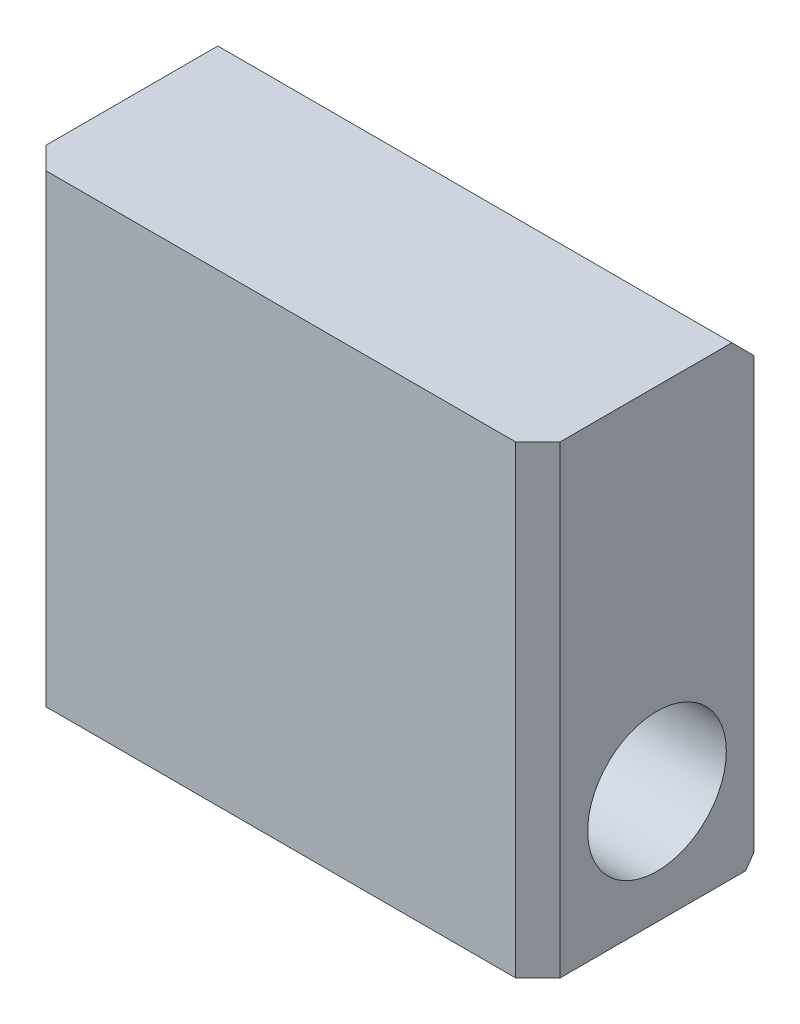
ISO-10303-21;
HEADER;
FILE_DESCRIPTION(('STEP AP214'),'2;1');
FILE_NAME('part.step','',(''),(''),'','','');
FILE_SCHEMA(('AUTOMOTIVE_DESIGN { 1 0 10303 214 1 1 1 1 }'));
ENDSEC;
DATA;
#1=APPLICATION_CONTEXT('core data for automotive mechanical design processes');
#2=APPLICATION_PROTOCOL_DEFINITION('international standard','automotive_design',2000,#1);
#3=PRODUCT_CONTEXT('',#1,'mechanical');
#4=PRODUCT('Part','Part','',(#3));
#5=PRODUCT_RELATED_PRODUCT_CATEGORY('part','',(#4));
#6=PRODUCT_DEFINITION_FORMATION('','',#4);
#7=PRODUCT_DEFINITION_CONTEXT('part definition',#1,'design');
#8=PRODUCT_DEFINITION('design','',#6,#7);
#9=PRODUCT_DEFINITION_SHAPE('','',#8);
#10=(LENGTH_UNIT() NAMED_UNIT(*) SI_UNIT(.MILLI.,.METRE.));
#11=(NAMED_UNIT(*) PLANE_ANGLE_UNIT() SI_UNIT($,.RADIAN.));
#12=(NAMED_UNIT(*) SI_UNIT($,.STERADIAN.) SOLID_ANGLE_UNIT());
#13=UNCERTAINTY_MEASURE_WITH_UNIT(LENGTH_MEASURE(1.E-05),#10,'distance_accuracy_value','');
#14=(GEOMETRIC_REPRESENTATION_CONTEXT(3) GLOBAL_UNCERTAINTY_ASSIGNED_CONTEXT((#13)) GLOBAL_UNIT_ASSIGNED_CONTEXT((#10,
#11,#12)) REPRESENTATION_CONTEXT('',''));
#15=CARTESIAN_POINT('',(0.,0.,0.));
#16=DIRECTION('',(0.,0.,1.));
#17=DIRECTION('',(1.,0.,0.));
#18=AXIS2_PLACEMENT_3D('',#15,#16,#17);
#19=CARTESIAN_POINT('',(13.2588,0.,0.));
#20=DIRECTION('',(-1.,0.,0.));
#21=DIRECTION('',(0.,0.,1.));
#22=AXIS2_PLACEMENT_3D('',#19,#20,#21);
#23=PLANE('',#22);
#24=DIRECTION('',(0.,1.,0.));
#25=VECTOR('',#24,1.);
#26=CARTESIAN_POINT('',(13.2588,0.,-5.00379999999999));
#27=LINE('',#26,#25);
#28=CARTESIAN_POINT('',(13.2588,-5.22532569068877,-5.00379999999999));
#29=VERTEX_POINT('',#28);
#30=CARTESIAN_POINT('',(13.2588,16.9672,-5.00379999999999));
#31=VERTEX_POINT('',#30);
#32=EDGE_CURVE('E180',#29,#31,#27,.T.);
#33=ORIENTED_EDGE('',*,*,#32,.T.);
#34=DIRECTION('',(0.,-0.707106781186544,-0.707106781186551));
#35=VECTOR('',#34,1.);
#36=CARTESIAN_POINT('',(13.2588,16.6328573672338,-5.33814263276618));
#37=LINE('',#36,#35);
#38=CARTESIAN_POINT('',(13.2588,18.1102,-3.86079999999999));
#39=VERTEX_POINT('',#38);
#40=EDGE_CURVE('E128',#39,#31,#37,.T.);
#41=ORIENTED_EDGE('',*,*,#40,.F.);
#42=DIRECTION('',(0.,0.,1.));
#43=VECTOR('',#42,1.);
#44=CARTESIAN_POINT('',(13.2588,18.1102,6.1468));
#45=LINE('',#44,#43);
#46=CARTESIAN_POINT('',(13.2588,18.1102,5.00379999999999));
#47=VERTEX_POINT('',#46);
#48=EDGE_CURVE('E136',#39,#47,#45,.T.);
#49=ORIENTED_EDGE('',*,*,#48,.T.);
#50=DIRECTION('',(0.,-1.,0.));
#51=VECTOR('',#50,1.);
#52=CARTESIAN_POINT('',(13.2588,0.,5.00379999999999));
#53=LINE('',#52,#51);
#54=CARTESIAN_POINT('',(13.2588,-5.842,5.00379999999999));
#55=VERTEX_POINT('',#54);
#56=EDGE_CURVE('E177',#47,#55,#53,.T.);
#57=ORIENTED_EDGE('',*,*,#56,.T.);
#58=DIRECTION('',(0.,0.,-1.));
#59=VECTOR('',#58,1.);
#60=CARTESIAN_POINT('',(13.2588,-5.842,6.1468));
#61=LINE('',#60,#59);
#62=CARTESIAN_POINT('',(13.2588,-5.842,-4.572));
#63=VERTEX_POINT('',#62);
#64=EDGE_CURVE('E146',#55,#63,#61,.T.);
#65=ORIENTED_EDGE('',*,*,#64,.T.);
#66=DIRECTION('',(0.,-0.819152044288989,0.57357643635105));
#67=VECTOR('',#66,1.);
#68=CARTESIAN_POINT('',(13.2588,-5.842,-4.572));
#69=LINE('',#68,#67);
#70=EDGE_CURVE('E203',#29,#63,#69,.T.);
#71=ORIENTED_EDGE('',*,*,#70,.F.);
#72=EDGE_LOOP('',(#33,#41,#49,#57,#65,#71));
#73=FACE_BOUND('',#72,.T.);
#74=CARTESIAN_POINT('',(13.2588,0.,0.));
#75=DIRECTION('',(1.,0.,0.));
#76=DIRECTION('',(0.,0.,-1.));
#77=AXIS2_PLACEMENT_3D('',#74,#75,#76);
#78=CIRCLE('',#77,3.57759);
#79=CARTESIAN_POINT('',(13.2588,0.,-3.57759));
#80=VERTEX_POINT('',#79);
#81=EDGE_CURVE('E152',#80,#80,#78,.T.);
#82=ORIENTED_EDGE('',*,*,#81,.F.);
#83=EDGE_LOOP('',(#82));
#84=FACE_BOUND('',#83,.T.);
#85=ADVANCED_FACE('F35',(#73,#84),#23,.F.);
#86=CARTESIAN_POINT('',(-13.2588,0.,0.));
#87=DIRECTION('',(-1.,0.,0.));
#88=DIRECTION('',(0.,0.,1.));
#89=AXIS2_PLACEMENT_3D('',#86,#87,#88);
#90=PLANE('',#89);
#91=DIRECTION('',(0.,-0.707106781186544,-0.707106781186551));
#92=VECTOR('',#91,1.);
#93=CARTESIAN_POINT('',(-13.2588,16.6328573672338,-5.33814263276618));
#94=LINE('',#93,#92);
#95=CARTESIAN_POINT('',(-13.2588,18.1102,-3.86079999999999));
#96=VERTEX_POINT('',#95);
#97=CARTESIAN_POINT('',(-13.2588,16.9672,-5.00379999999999));
#98=VERTEX_POINT('',#97);
#99=EDGE_CURVE('E118',#96,#98,#94,.T.);
#100=ORIENTED_EDGE('',*,*,#99,.T.);
#101=DIRECTION('',(0.,-1.,0.));
#102=VECTOR('',#101,1.);
#103=CARTESIAN_POINT('',(-13.2588,-5.842,-5.00379999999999));
#104=LINE('',#103,#102);
#105=CARTESIAN_POINT('',(-13.2588,-5.22532569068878,-5.00379999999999));
#106=VERTEX_POINT('',#105);
#107=EDGE_CURVE('E171',#98,#106,#104,.T.);
#108=ORIENTED_EDGE('',*,*,#107,.T.);
#109=DIRECTION('',(0.,-0.819152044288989,0.57357643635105));
#110=VECTOR('',#109,1.);
#111=CARTESIAN_POINT('',(-13.2588,-5.842,-4.572));
#112=LINE('',#111,#110);
#113=CARTESIAN_POINT('',(-13.2588,-5.842,-4.572));
#114=VERTEX_POINT('',#113);
#115=EDGE_CURVE('E209',#106,#114,#112,.T.);
#116=ORIENTED_EDGE('',*,*,#115,.T.);
#117=DIRECTION('',(0.,0.,-1.));
#118=VECTOR('',#117,1.);
#119=CARTESIAN_POINT('',(-13.2588,-5.842,6.1468));
#120=LINE('',#119,#118);
#121=CARTESIAN_POINT('',(-13.2588,-5.842,5.00379999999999));
#122=VERTEX_POINT('',#121);
#123=EDGE_CURVE('E147',#122,#114,#120,.T.);
#124=ORIENTED_EDGE('',*,*,#123,.F.);
#125=DIRECTION('',(0.,1.,0.));
#126=VECTOR('',#125,1.);
#127=CARTESIAN_POINT('',(-13.2588,18.1102,5.00379999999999));
#128=LINE('',#127,#126);
#129=CARTESIAN_POINT('',(-13.2588,18.1102,5.00379999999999));
#130=VERTEX_POINT('',#129);
#131=EDGE_CURVE('E144',#122,#130,#128,.T.);
#132=ORIENTED_EDGE('',*,*,#131,.T.);
#133=DIRECTION('',(0.,0.,1.));
#134=VECTOR('',#133,1.);
#135=CARTESIAN_POINT('',(-13.2588,18.1102,6.1468));
#136=LINE('',#135,#134);
#137=EDGE_CURVE('E133',#96,#130,#136,.T.);
#138=ORIENTED_EDGE('',*,*,#137,.F.);
#139=EDGE_LOOP('',(#100,#108,#116,#124,#132,#138));
#140=FACE_BOUND('',#139,.T.);
#141=CARTESIAN_POINT('',(-13.2588,0.,0.));
#142=DIRECTION('',(1.,0.,0.));
#143=DIRECTION('',(0.,0.,-1.));
#144=AXIS2_PLACEMENT_3D('',#141,#142,#143);
#145=CIRCLE('',#144,3.57759);
#146=CARTESIAN_POINT('',(-13.2588,0.,-3.57759));
#147=VERTEX_POINT('',#146);
#148=EDGE_CURVE('E220',#147,#147,#145,.T.);
#149=ORIENTED_EDGE('',*,*,#148,.T.);
#150=EDGE_LOOP('',(#149));
#151=FACE_BOUND('',#150,.T.);
#152=ADVANCED_FACE('F140',(#140,#151),#90,.T.);
#153=CARTESIAN_POINT('',(13.2588,-5.842,6.1468));
#154=DIRECTION('',(0.,0.,-1.));
#155=DIRECTION('',(-1.,0.,0.));
#156=AXIS2_PLACEMENT_3D('',#153,#154,#155);
#157=PLANE('',#156);
#158=DIRECTION('',(-1.,0.,0.));
#159=VECTOR('',#158,1.);
#160=CARTESIAN_POINT('',(13.2588,18.1102,6.1468));
#161=LINE('',#160,#159);
#162=CARTESIAN_POINT('',(12.1158,18.1102,6.1468));
#163=VERTEX_POINT('',#162);
#164=CARTESIAN_POINT('',(-12.1158,18.1102,6.1468));
#165=VERTEX_POINT('',#164);
#166=EDGE_CURVE('E156',#163,#165,#161,.T.);
#167=ORIENTED_EDGE('',*,*,#166,.T.);
#168=DIRECTION('',(0.,-1.,0.));
#169=VECTOR('',#168,1.);
#170=CARTESIAN_POINT('',(-12.1158,-5.842,6.1468));
#171=LINE('',#170,#169);
#172=CARTESIAN_POINT('',(-12.1158,-5.842,6.1468));
#173=VERTEX_POINT('',#172);
#174=EDGE_CURVE('E185',#165,#173,#171,.T.);
#175=ORIENTED_EDGE('',*,*,#174,.T.);
#176=DIRECTION('',(-1.,0.,0.));
#177=VECTOR('',#176,1.);
#178=CARTESIAN_POINT('',(13.2588,-5.842,6.1468));
#179=LINE('',#178,#177);
#180=CARTESIAN_POINT('',(12.1158,-5.842,6.1468));
#181=VERTEX_POINT('',#180);
#182=EDGE_CURVE('E159',#181,#173,#179,.T.);
#183=ORIENTED_EDGE('',*,*,#182,.F.);
#184=DIRECTION('',(0.,1.,0.));
#185=VECTOR('',#184,1.);
#186=CARTESIAN_POINT('',(12.1158,-5.842,6.1468));
#187=LINE('',#186,#185);
#188=EDGE_CURVE('E183',#181,#163,#187,.T.);
#189=ORIENTED_EDGE('',*,*,#188,.T.);
#190=EDGE_LOOP('',(#167,#175,#183,#189));
#191=FACE_BOUND('',#190,.T.);
#192=ADVANCED_FACE('F233',(#191),#157,.F.);
#193=CARTESIAN_POINT('',(13.2588,-5.842,6.1468));
#194=DIRECTION('',(0.,1.,0.));
#195=DIRECTION('',(0.,0.,1.));
#196=AXIS2_PLACEMENT_3D('',#193,#194,#195);
#197=PLANE('',#196);
#198=ORIENTED_EDGE('',*,*,#123,.T.);
#199=DIRECTION('',(1.,0.,0.));
#200=VECTOR('',#199,1.);
#201=CARTESIAN_POINT('',(-13.2588,-5.842,-4.572));
#202=LINE('',#201,#200);
#203=EDGE_CURVE('E215',#114,#63,#202,.T.);
#204=ORIENTED_EDGE('',*,*,#203,.T.);
#205=ORIENTED_EDGE('',*,*,#64,.F.);
#206=DIRECTION('',(0.70710678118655,0.,-0.707106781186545));
#207=VECTOR('',#206,1.);
#208=CARTESIAN_POINT('',(13.2588,-5.842,5.00379999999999));
#209=LINE('',#208,#207);
#210=EDGE_CURVE('E173',#55,#181,#209,.F.);
#211=ORIENTED_EDGE('',*,*,#210,.T.);
#212=ORIENTED_EDGE('',*,*,#182,.T.);
#213=DIRECTION('',(-0.707106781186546,0.,-0.707106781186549));
#214=VECTOR('',#213,1.);
#215=CARTESIAN_POINT('',(-12.1158,-5.842,6.1468));
#216=LINE('',#215,#214);
#217=EDGE_CURVE('E175',#173,#122,#216,.T.);
#218=ORIENTED_EDGE('',*,*,#217,.T.);
#219=EDGE_LOOP('',(#198,#204,#205,#211,#212,#218));
#220=FACE_BOUND('',#219,.T.);
#221=ADVANCED_FACE('F231',(#220),#197,.F.);
#222=CARTESIAN_POINT('',(13.2588,-5.842,-6.1468));
#223=DIRECTION('',(0.,0.,1.));
#224=DIRECTION('',(1.,0.,0.));
#225=AXIS2_PLACEMENT_3D('',#222,#223,#224);
#226=PLANE('',#225);
#227=DIRECTION('',(0.,1.,0.));
#228=VECTOR('',#227,1.);
#229=CARTESIAN_POINT('',(-12.1158,18.1102,-6.1468));
#230=LINE('',#229,#228);
#231=CARTESIAN_POINT('',(-12.1158,-3.59295251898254,-6.1468));
#232=VERTEX_POINT('',#231);
#233=CARTESIAN_POINT('',(-12.1158,13.5060113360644,-6.1468));
#234=VERTEX_POINT('',#233);
#235=EDGE_CURVE('E163',#232,#234,#230,.T.);
#236=ORIENTED_EDGE('',*,*,#235,.T.);
#237=DIRECTION('',(1.,0.,0.));
#238=VECTOR('',#237,1.);
#239=CARTESIAN_POINT('',(-13.2588,13.5060113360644,-6.1468));
#240=LINE('',#239,#238);
#241=CARTESIAN_POINT('',(12.1158,13.5060113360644,-6.1468));
#242=VERTEX_POINT('',#241);
#243=EDGE_CURVE('E138',#234,#242,#240,.T.);
#244=ORIENTED_EDGE('',*,*,#243,.T.);
#245=DIRECTION('',(0.,-1.,0.));
#246=VECTOR('',#245,1.);
#247=CARTESIAN_POINT('',(12.1158,-5.842,-6.1468));
#248=LINE('',#247,#246);
#249=CARTESIAN_POINT('',(12.1158,-3.59295251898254,-6.1468));
#250=VERTEX_POINT('',#249);
#251=EDGE_CURVE('E57',#242,#250,#248,.T.);
#252=ORIENTED_EDGE('',*,*,#251,.T.);
#253=DIRECTION('',(1.,0.,0.));
#254=VECTOR('',#253,1.);
#255=CARTESIAN_POINT('',(-13.2588,-3.59295251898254,-6.1468));
#256=LINE('',#255,#254);
#257=EDGE_CURVE('E205',#232,#250,#256,.T.);
#258=ORIENTED_EDGE('',*,*,#257,.F.);
#259=EDGE_LOOP('',(#236,#244,#252,#258));
#260=FACE_BOUND('',#259,.T.);
#261=ADVANCED_FACE('F194',(#260),#226,.F.);
#262=CARTESIAN_POINT('',(13.2588,18.1102,6.1468));
#263=DIRECTION('',(0.,-1.,0.));
#264=DIRECTION('',(0.,0.,-1.));
#265=AXIS2_PLACEMENT_3D('',#262,#263,#264);
#266=PLANE('',#265);
#267=ORIENTED_EDGE('',*,*,#48,.F.);
#268=DIRECTION('',(1.,0.,0.));
#269=VECTOR('',#268,1.);
#270=CARTESIAN_POINT('',(-13.2588,18.1102,-3.86079999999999));
#271=LINE('',#270,#269);
#272=EDGE_CURVE('E121',#96,#39,#271,.T.);
#273=ORIENTED_EDGE('',*,*,#272,.F.);
#274=ORIENTED_EDGE('',*,*,#137,.T.);
#275=DIRECTION('',(0.707106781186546,0.,0.707106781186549));
#276=VECTOR('',#275,1.);
#277=CARTESIAN_POINT('',(-12.1158,18.1102,6.1468));
#278=LINE('',#277,#276);
#279=EDGE_CURVE('E168',#130,#165,#278,.T.);
#280=ORIENTED_EDGE('',*,*,#279,.T.);
#281=ORIENTED_EDGE('',*,*,#166,.F.);
#282=DIRECTION('',(-0.70710678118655,0.,0.707106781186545));
#283=VECTOR('',#282,1.);
#284=CARTESIAN_POINT('',(13.2588,18.1102,5.00379999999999));
#285=LINE('',#284,#283);
#286=EDGE_CURVE('E166',#163,#47,#285,.F.);
#287=ORIENTED_EDGE('',*,*,#286,.T.);
#288=EDGE_LOOP('',(#267,#273,#274,#280,#281,#287));
#289=FACE_BOUND('',#288,.T.);
#290=ADVANCED_FACE('F132',(#289),#266,.F.);
#291=CARTESIAN_POINT('',(13.2588,0.,0.));
#292=DIRECTION('',(-1.,0.,0.));
#293=DIRECTION('',(0.,0.,1.));
#294=AXIS2_PLACEMENT_3D('',#291,#292,#293);
#295=CYLINDRICAL_SURFACE('',#294,3.57759);
#296=ORIENTED_EDGE('',*,*,#81,.T.);
#297=EDGE_LOOP('',(#296));
#298=FACE_BOUND('',#297,.T.);
#299=ORIENTED_EDGE('',*,*,#148,.F.);
#300=EDGE_LOOP('',(#299));
#301=FACE_BOUND('',#300,.T.);
#302=ADVANCED_FACE('F245',(#298,#301),#295,.F.);
#303=CARTESIAN_POINT('',(-12.1158,-5.842,-6.1468));
#304=DIRECTION('',(-0.707106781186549,0.,-0.707106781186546));
#305=DIRECTION('',(0.,-1.,0.));
#306=AXIS2_PLACEMENT_3D('',#303,#304,#305);
#307=PLANE('',#306);
#308=DIRECTION('',(-0.577350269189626,0.577350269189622,0.577350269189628));
#309=VECTOR('',#308,1.);
#310=CARTESIAN_POINT('',(-4.89373333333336,8.60213333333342,-13.3688666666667));
#311=LINE('',#310,#309);
#312=CARTESIAN_POINT('',(-12.9244573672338,16.6328573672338,-5.33814263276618));
#313=VERTEX_POINT('',#312);
#314=EDGE_CURVE('E124',#313,#98,#311,.T.);
#315=ORIENTED_EDGE('',*,*,#314,.F.);
#316=DIRECTION('',(-0.242882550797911,0.939157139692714,0.242882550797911));
#317=VECTOR('',#316,1.);
#318=CARTESIAN_POINT('',(-7.70242416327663,-3.55924680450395,-10.5601758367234));
#319=LINE('',#318,#317);
#320=EDGE_CURVE('E137',#234,#313,#319,.T.);
#321=ORIENTED_EDGE('',*,*,#320,.F.);
#322=ORIENTED_EDGE('',*,*,#235,.F.);
#323=DIRECTION('',(0.497542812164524,0.710564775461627,-0.497542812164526));
#324=VECTOR('',#323,1.);
#325=CARTESIAN_POINT('',(-12.9109201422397,-4.72850176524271,-5.35167985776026));
#326=LINE('',#325,#324);
#327=EDGE_CURVE('E217',#106,#232,#326,.T.);
#328=ORIENTED_EDGE('',*,*,#327,.F.);
#329=ORIENTED_EDGE('',*,*,#107,.F.);
#330=EDGE_LOOP('',(#315,#321,#322,#328,#329));
#331=FACE_BOUND('',#330,.T.);
#332=ADVANCED_FACE('F240',(#331),#307,.T.);
#333=CARTESIAN_POINT('',(13.2588,0.,-5.00379999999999));
#334=DIRECTION('',(-0.707106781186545,0.,0.70710678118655));
#335=DIRECTION('',(0.,1.,0.));
#336=AXIS2_PLACEMENT_3D('',#333,#334,#335);
#337=PLANE('',#336);
#338=DIRECTION('',(0.57735026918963,0.577350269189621,0.577350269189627));
#339=VECTOR('',#338,1.);
#340=CARTESIAN_POINT('',(7.60306666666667,11.3114666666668,-10.6595333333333));
#341=LINE('',#340,#339);
#342=CARTESIAN_POINT('',(12.9244573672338,16.6328573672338,-5.33814263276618));
#343=VERTEX_POINT('',#342);
#344=EDGE_CURVE('E11',#31,#343,#341,.F.);
#345=ORIENTED_EDGE('',*,*,#344,.F.);
#346=ORIENTED_EDGE('',*,*,#32,.F.);
#347=DIRECTION('',(-0.497542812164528,0.710564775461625,-0.497542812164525));
#348=VECTOR('',#347,1.);
#349=CARTESIAN_POINT('',(11.4114571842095,-2.58704673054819,-6.85114281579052));
#350=LINE('',#349,#348);
#351=EDGE_CURVE('E188',#250,#29,#350,.F.);
#352=ORIENTED_EDGE('',*,*,#351,.F.);
#353=ORIENTED_EDGE('',*,*,#251,.F.);
#354=DIRECTION('',(0.242882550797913,0.939157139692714,0.242882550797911));
#355=VECTOR('',#354,1.);
#356=CARTESIAN_POINT('',(9.1698684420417,2.11493920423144,-9.09273155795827));
#357=LINE('',#356,#355);
#358=EDGE_CURVE('E43',#343,#242,#357,.F.);
#359=ORIENTED_EDGE('',*,*,#358,.F.);
#360=EDGE_LOOP('',(#345,#346,#352,#353,#359));
#361=FACE_BOUND('',#360,.T.);
#362=ADVANCED_FACE('F198',(#361),#337,.F.);
#363=CARTESIAN_POINT('',(-12.1158,-5.842,6.1468));
#364=DIRECTION('',(-0.707106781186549,0.,0.707106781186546));
#365=DIRECTION('',(0.,1.,0.));
#366=AXIS2_PLACEMENT_3D('',#363,#364,#365);
#367=PLANE('',#366);
#368=ORIENTED_EDGE('',*,*,#279,.F.);
#369=ORIENTED_EDGE('',*,*,#131,.F.);
#370=ORIENTED_EDGE('',*,*,#217,.F.);
#371=ORIENTED_EDGE('',*,*,#174,.F.);
#372=EDGE_LOOP('',(#368,#369,#370,#371));
#373=FACE_BOUND('',#372,.T.);
#374=ADVANCED_FACE('F236',(#373),#367,.T.);
#375=CARTESIAN_POINT('',(13.2588,0.,5.00379999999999));
#376=DIRECTION('',(-0.707106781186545,0.,-0.70710678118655));
#377=DIRECTION('',(0.,-1.,0.));
#378=AXIS2_PLACEMENT_3D('',#375,#376,#377);
#379=PLANE('',#378);
#380=ORIENTED_EDGE('',*,*,#286,.F.);
#381=ORIENTED_EDGE('',*,*,#188,.F.);
#382=ORIENTED_EDGE('',*,*,#210,.F.);
#383=ORIENTED_EDGE('',*,*,#56,.F.);
#384=EDGE_LOOP('',(#380,#381,#382,#383));
#385=FACE_BOUND('',#384,.T.);
#386=ADVANCED_FACE('F37',(#385),#379,.F.);
#387=CARTESIAN_POINT('',(-13.2588,-5.842,-4.572));
#388=DIRECTION('',(0.,0.57357643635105,0.819152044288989));
#389=DIRECTION('',(0.,-0.819152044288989,0.57357643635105));
#390=AXIS2_PLACEMENT_3D('',#387,#388,#389);
#391=PLANE('',#390);
#392=ORIENTED_EDGE('',*,*,#327,.T.);
#393=ORIENTED_EDGE('',*,*,#257,.T.);
#394=ORIENTED_EDGE('',*,*,#351,.T.);
#395=ORIENTED_EDGE('',*,*,#70,.T.);
#396=ORIENTED_EDGE('',*,*,#203,.F.);
#397=ORIENTED_EDGE('',*,*,#115,.F.);
#398=EDGE_LOOP('',(#392,#393,#394,#395,#396,#397));
#399=FACE_BOUND('',#398,.T.);
#400=ADVANCED_FACE('F202',(#399),#391,.F.);
#401=CARTESIAN_POINT('',(-13.2588,16.6328573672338,-5.33814263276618));
#402=DIRECTION('',(0.,-0.707106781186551,0.707106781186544));
#403=DIRECTION('',(0.,-0.707106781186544,-0.707106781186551));
#404=AXIS2_PLACEMENT_3D('',#401,#402,#403);
#405=PLANE('',#404);
#406=ORIENTED_EDGE('',*,*,#314,.T.);
#407=ORIENTED_EDGE('',*,*,#99,.F.);
#408=ORIENTED_EDGE('',*,*,#272,.T.);
#409=ORIENTED_EDGE('',*,*,#40,.T.);
#410=ORIENTED_EDGE('',*,*,#344,.T.);
#411=DIRECTION('',(1.,0.,0.));
#412=VECTOR('',#411,1.);
#413=CARTESIAN_POINT('',(-13.2588,16.6328573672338,-5.33814263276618));
#414=LINE('',#413,#412);
#415=EDGE_CURVE('E50',#313,#343,#414,.T.);
#416=ORIENTED_EDGE('',*,*,#415,.F.);
#417=EDGE_LOOP('',(#406,#407,#408,#409,#410,#416));
#418=FACE_BOUND('',#417,.T.);
#419=ADVANCED_FACE('F120',(#418),#405,.F.);
#420=CARTESIAN_POINT('',(-13.2588,13.5060113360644,-6.1468));
#421=DIRECTION('',(0.,-0.250380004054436,0.968147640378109));
#422=DIRECTION('',(0.,-0.968147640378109,-0.250380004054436));
#423=AXIS2_PLACEMENT_3D('',#420,#421,#422);
#424=PLANE('',#423);
#425=ORIENTED_EDGE('',*,*,#320,.T.);
#426=ORIENTED_EDGE('',*,*,#415,.T.);
#427=ORIENTED_EDGE('',*,*,#358,.T.);
#428=ORIENTED_EDGE('',*,*,#243,.F.);
#429=EDGE_LOOP('',(#425,#426,#427,#428));
#430=FACE_BOUND('',#429,.T.);
#431=ADVANCED_FACE('F190',(#430),#424,.F.);
#432=CLOSED_SHELL('',(#85,#152,#192,#221,#261,#290,#302,#332,#362,#374,#386,#400,#419,#431));
#433=MANIFOLD_SOLID_BREP('B2',#432);
#434=ADVANCED_BREP_SHAPE_REPRESENTATION('',(#18,#433),#14);
#435=SHAPE_DEFINITION_REPRESENTATION(#9,#434);
ENDSEC;
END-ISO-10303-21;
